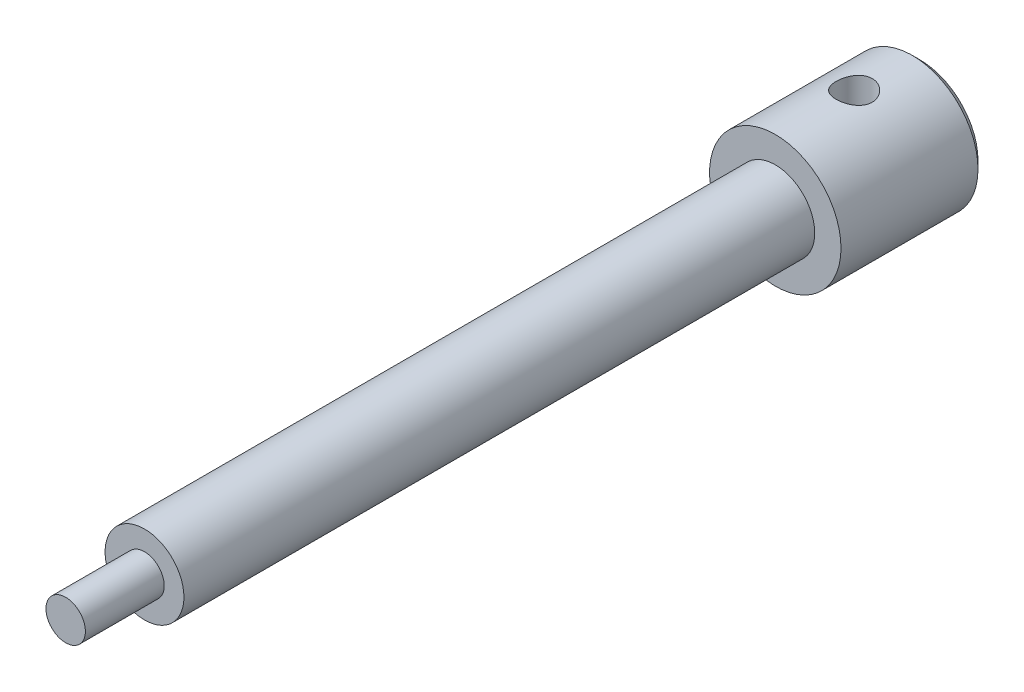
ISO-10303-21;
HEADER;
FILE_DESCRIPTION(('STEP AP214'),'2;1');
FILE_NAME('part.step','',(''),(''),'','','');
FILE_SCHEMA(('AUTOMOTIVE_DESIGN { 1 0 10303 214 1 1 1 1 }'));
ENDSEC;
DATA;
#1=APPLICATION_CONTEXT('core data for automotive mechanical design processes');
#2=APPLICATION_PROTOCOL_DEFINITION('international standard','automotive_design',2000,#1);
#3=PRODUCT_CONTEXT('',#1,'mechanical');
#4=PRODUCT('Part','Part','',(#3));
#5=PRODUCT_RELATED_PRODUCT_CATEGORY('part','',(#4));
#6=PRODUCT_DEFINITION_FORMATION('','',#4);
#7=PRODUCT_DEFINITION_CONTEXT('part definition',#1,'design');
#8=PRODUCT_DEFINITION('design','',#6,#7);
#9=PRODUCT_DEFINITION_SHAPE('','',#8);
#10=(LENGTH_UNIT() NAMED_UNIT(*) SI_UNIT(.MILLI.,.METRE.));
#11=(NAMED_UNIT(*) PLANE_ANGLE_UNIT() SI_UNIT($,.RADIAN.));
#12=(NAMED_UNIT(*) SI_UNIT($,.STERADIAN.) SOLID_ANGLE_UNIT());
#13=UNCERTAINTY_MEASURE_WITH_UNIT(LENGTH_MEASURE(1.E-05),#10,'distance_accuracy_value','');
#14=(GEOMETRIC_REPRESENTATION_CONTEXT(3) GLOBAL_UNCERTAINTY_ASSIGNED_CONTEXT((#13)) GLOBAL_UNIT_ASSIGNED_CONTEXT((#10,
#11,#12)) REPRESENTATION_CONTEXT('',''));
#15=CARTESIAN_POINT('',(0.,0.,0.));
#16=DIRECTION('',(0.,0.,1.));
#17=DIRECTION('',(1.,0.,0.));
#18=AXIS2_PLACEMENT_3D('',#15,#16,#17);
#19=CARTESIAN_POINT('',(0.,0.,-22.));
#20=DIRECTION('',(0.,0.,1.));
#21=DIRECTION('',(1.,0.,0.));
#22=AXIS2_PLACEMENT_3D('',#19,#20,#21);
#23=CYLINDRICAL_SURFACE('',#22,10.);
#24=CARTESIAN_POINT('',(0.,0.,-20.85));
#25=DIRECTION('',(0.,0.,1.));
#26=DIRECTION('',(1.,0.,0.));
#27=AXIS2_PLACEMENT_3D('',#24,#25,#26);
#28=CIRCLE('',#27,10.);
#29=CARTESIAN_POINT('',(10.,0.,-20.85));
#30=VERTEX_POINT('',#29);
#31=EDGE_CURVE('E57',#30,#30,#28,.T.);
#32=ORIENTED_EDGE('',*,*,#31,.T.);
#33=EDGE_LOOP('',(#32));
#34=FACE_BOUND('',#33,.T.);
#35=CARTESIAN_POINT('',(0.,-10.,-9.25));
#36=CARTESIAN_POINT('',(-0.15142288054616,-9.99999790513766,-9.25000321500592));
#37=CARTESIAN_POINT('',(-0.30287955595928,-9.99652704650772,-9.26254850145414));
#38=CARTESIAN_POINT('',(-0.601418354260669,-9.9830186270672,-9.31230216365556));
#39=CARTESIAN_POINT('',(-0.748498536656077,-9.97297819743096,-9.34952131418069));
#40=CARTESIAN_POINT('',(-1.03393279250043,-9.94743692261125,-9.44731247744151));
#41=CARTESIAN_POINT('',(-1.17229822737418,-9.93194336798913,-9.50785332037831));
#42=CARTESIAN_POINT('',(-1.43691255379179,-9.89712668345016,-9.65045078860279));
#43=CARTESIAN_POINT('',(-1.56316043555,-9.8778032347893,-9.73250920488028));
#44=CARTESIAN_POINT('',(-1.80305227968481,-9.83687707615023,-9.917936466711));
#45=CARTESIAN_POINT('',(-1.91635675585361,-9.81523348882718,-10.0217354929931));
#46=CARTESIAN_POINT('',(-2.12418937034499,-9.77236429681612,-10.2467786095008));
#47=CARTESIAN_POINT('',(-2.21871492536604,-9.75113874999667,-10.3680250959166));
#48=CARTESIAN_POINT('',(-2.3879928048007,-9.71108741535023,-10.6272699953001));
#49=CARTESIAN_POINT('',(-2.46234890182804,-9.69231302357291,-10.7655358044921));
#50=CARTESIAN_POINT('',(-2.58662289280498,-9.65989315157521,-11.0532068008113));
#51=CARTESIAN_POINT('',(-2.63654561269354,-9.64624665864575,-11.202609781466));
#52=CARTESIAN_POINT('',(-2.70934583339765,-9.62605068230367,-11.5045411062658));
#53=CARTESIAN_POINT('',(-2.73284141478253,-9.61933931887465,-11.6569093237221));
#54=CARTESIAN_POINT('',(-2.75404817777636,-9.61329031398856,-11.9635612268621));
#55=CARTESIAN_POINT('',(-2.75176451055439,-9.61395119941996,-12.1178445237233));
#56=CARTESIAN_POINT('',(-2.72196703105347,-9.62242747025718,-12.4190757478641));
#57=CARTESIAN_POINT('',(-2.69520726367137,-9.63002901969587,-12.5661052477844));
#58=CARTESIAN_POINT('',(-2.61842742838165,-9.65118687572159,-12.8535025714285));
#59=CARTESIAN_POINT('',(-2.56840539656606,-9.66474368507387,-12.9938698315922));
#60=CARTESIAN_POINT('',(-2.4459209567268,-9.6964683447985,-13.2658944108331));
#61=CARTESIAN_POINT('',(-2.37319900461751,-9.71468906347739,-13.3974284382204));
#62=CARTESIAN_POINT('',(-2.20755990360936,-9.75366083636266,-13.6466884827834));
#63=CARTESIAN_POINT('',(-2.11463855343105,-9.77441241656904,-13.7644116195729));
#64=CARTESIAN_POINT('',(-1.90740929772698,-9.81699239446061,-13.9870091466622));
#65=CARTESIAN_POINT('',(-1.79246989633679,-9.83883313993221,-14.0912941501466));
#66=CARTESIAN_POINT('',(-1.54646529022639,-9.88048509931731,-14.2792334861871));
#67=CARTESIAN_POINT('',(-1.41539936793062,-9.90029622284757,-14.3628869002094));
#68=CARTESIAN_POINT('',(-1.13991171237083,-9.93579173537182,-14.5074709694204));
#69=CARTESIAN_POINT('',(-0.99542816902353,-9.95145560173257,-14.5682892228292));
#70=CARTESIAN_POINT('',(-0.697756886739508,-9.97674362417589,-14.6645994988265));
#71=CARTESIAN_POINT('',(-0.544571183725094,-9.98636918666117,-14.7000974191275));
#72=CARTESIAN_POINT('',(-0.238869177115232,-9.9982810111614,-14.7438206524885));
#73=CARTESIAN_POINT('',(-0.0864756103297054,-10.000782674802,-14.7528466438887));
#74=CARTESIAN_POINT('',(0.217649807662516,-9.9987871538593,-14.7455888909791));
#75=CARTESIAN_POINT('',(0.369381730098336,-9.99429074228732,-14.7293079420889));
#76=CARTESIAN_POINT('',(0.664979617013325,-9.97894393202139,-14.6725532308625));
#77=CARTESIAN_POINT('',(0.808939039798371,-9.9682122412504,-14.6325311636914));
#78=CARTESIAN_POINT('',(1.0880827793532,-9.94161719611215,-14.5299593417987));
#79=CARTESIAN_POINT('',(1.22326611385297,-9.92575326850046,-14.4674070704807));
#80=CARTESIAN_POINT('',(1.48409215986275,-9.8901549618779,-14.3200996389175));
#81=CARTESIAN_POINT('',(1.60948250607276,-9.8703479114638,-14.2349156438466));
#82=CARTESIAN_POINT('',(1.84446827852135,-9.82915015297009,-14.0452974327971));
#83=CARTESIAN_POINT('',(1.95406037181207,-9.80775911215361,-13.9408591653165));
#84=CARTESIAN_POINT('',(2.15775026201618,-9.7650031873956,-13.7119525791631));
#85=CARTESIAN_POINT('',(2.251281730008,-9.74365851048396,-13.5869755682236));
#86=CARTESIAN_POINT('',(2.41606367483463,-9.70411480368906,-13.3226441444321));
#87=CARTESIAN_POINT('',(2.48731502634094,-9.68591565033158,-13.183290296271));
#88=CARTESIAN_POINT('',(2.60498194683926,-9.65493519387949,-12.8948127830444));
#89=CARTESIAN_POINT('',(2.65153712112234,-9.64212352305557,-12.7457495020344));
#90=CARTESIAN_POINT('',(2.71879365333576,-9.62337795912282,-12.4414941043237));
#91=CARTESIAN_POINT('',(2.73950213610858,-9.61744217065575,-12.2863036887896));
#92=CARTESIAN_POINT('',(2.75404886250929,-9.6132857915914,-11.9800168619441));
#93=CARTESIAN_POINT('',(2.7488002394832,-9.614803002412,-11.8289667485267));
#94=CARTESIAN_POINT('',(2.71371466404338,-9.62476380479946,-11.5299943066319));
#95=CARTESIAN_POINT('',(2.6838784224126,-9.63320719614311,-11.3820718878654));
#96=CARTESIAN_POINT('',(2.60100915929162,-9.65590796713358,-11.0947850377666));
#97=CARTESIAN_POINT('',(2.54818121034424,-9.67011387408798,-10.955357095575));
#98=CARTESIAN_POINT('',(2.4209868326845,-9.70273746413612,-10.6872356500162));
#99=CARTESIAN_POINT('',(2.34661683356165,-9.72115584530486,-10.5585439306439));
#100=CARTESIAN_POINT('',(2.17573113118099,-9.76084545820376,-10.31121804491));
#101=CARTESIAN_POINT('',(2.07859788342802,-9.78218767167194,-10.1930219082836));
#102=CARTESIAN_POINT('',(1.86610223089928,-9.82493707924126,-9.97431048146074));
#103=CARTESIAN_POINT('',(1.75073533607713,-9.84634428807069,-9.87379955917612));
#104=CARTESIAN_POINT('',(1.50182041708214,-9.88740569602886,-9.69101234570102));
#105=CARTESIAN_POINT('',(1.36791284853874,-9.907007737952,-9.60921290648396));
#106=CARTESIAN_POINT('',(1.08770978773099,-9.94166772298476,-9.46941355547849));
#107=CARTESIAN_POINT('',(0.941421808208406,-9.95672839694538,-9.41139933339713));
#108=CARTESIAN_POINT('',(0.663199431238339,-9.97880995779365,-9.3278272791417));
#109=CARTESIAN_POINT('',(0.532391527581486,-9.9866965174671,-9.29871242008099));
#110=CARTESIAN_POINT('',(0.267730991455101,-9.9972921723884,-9.25979844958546));
#111=CARTESIAN_POINT('',(0.13387870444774,-10.0000018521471,-9.24999715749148));
#112=CARTESIAN_POINT('',(0.,-10.,-9.25));
#113=B_SPLINE_CURVE_WITH_KNOTS('',3,(#35,#36,#37,#38,#39,#40,#41,#42,#43,#44,#45,#46,#47,#48,
#49,#50,#51,#52,#53,#54,#55,#56,#57,#58,#59,#60,#61,#62,#63,#64,#65,#66,#67,#68,#69,#70,#71,#72,
#73,#74,#75,#76,#77,#78,#79,#80,#81,#82,#83,#84,#85,#86,#87,#88,#89,#90,#91,#92,#93,#94,#95,#96,
#97,#98,#99,#100,#101,#102,#103,#104,#105,#106,#107,#108,#109,#110,#111,#112),.UNSPECIFIED.,.T.,
.F.,(4,2,2,2,2,2,2,2,2,2,2,2,2,2,2,2,2,2,2,2,2,2,2,2,2,2,2,2,2,2,2,2,2,2,2,2,2,2,4),(0.,
0.45377748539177,0.907753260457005,1.36112438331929,1.81453325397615,2.27794447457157,
2.74141939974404,3.21343018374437,3.68534770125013,4.14598225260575,4.60652476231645,
5.0533402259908,5.50019341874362,5.9523554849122,6.40461168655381,6.87259959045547,
7.34060832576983,7.81089145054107,8.28106499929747,8.73686293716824,9.19261053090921,
9.63995333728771,10.0873461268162,10.5439096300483,11.0005693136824,11.4709880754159,
11.9413883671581,12.4091004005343,12.8766834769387,13.3279371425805,13.7791777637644,
14.2264735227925,14.6738434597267,15.1351456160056,15.5965615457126,16.0686764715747,
16.5405069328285,16.9417541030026,17.3429559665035),.UNSPECIFIED.);
#114=CARTESIAN_POINT('',(0.,-10.,-9.25));
#115=VERTEX_POINT('',#114);
#116=EDGE_CURVE('E61',#115,#115,#113,.T.);
#117=ORIENTED_EDGE('',*,*,#116,.F.);
#118=EDGE_LOOP('',(#117));
#119=FACE_BOUND('',#118,.T.);
#120=CARTESIAN_POINT('',(0.,10.,-9.25));
#121=CARTESIAN_POINT('',(0.15142288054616,9.99999790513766,-9.25000321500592));
#122=CARTESIAN_POINT('',(0.30287955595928,9.99652704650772,-9.26254850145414));
#123=CARTESIAN_POINT('',(0.601418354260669,9.9830186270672,-9.31230216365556));
#124=CARTESIAN_POINT('',(0.748498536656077,9.97297819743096,-9.34952131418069));
#125=CARTESIAN_POINT('',(1.03393279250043,9.94743692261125,-9.44731247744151));
#126=CARTESIAN_POINT('',(1.17229822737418,9.93194336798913,-9.50785332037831));
#127=CARTESIAN_POINT('',(1.43691255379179,9.89712668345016,-9.65045078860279));
#128=CARTESIAN_POINT('',(1.56316043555,9.8778032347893,-9.73250920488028));
#129=CARTESIAN_POINT('',(1.80305227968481,9.83687707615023,-9.917936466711));
#130=CARTESIAN_POINT('',(1.91635675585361,9.81523348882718,-10.0217354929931));
#131=CARTESIAN_POINT('',(2.12418937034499,9.77236429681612,-10.2467786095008));
#132=CARTESIAN_POINT('',(2.21871492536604,9.75113874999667,-10.3680250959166));
#133=CARTESIAN_POINT('',(2.3879928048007,9.71108741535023,-10.6272699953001));
#134=CARTESIAN_POINT('',(2.46234890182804,9.69231302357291,-10.7655358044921));
#135=CARTESIAN_POINT('',(2.58662289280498,9.65989315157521,-11.0532068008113));
#136=CARTESIAN_POINT('',(2.63654561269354,9.64624665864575,-11.202609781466));
#137=CARTESIAN_POINT('',(2.70934583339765,9.62605068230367,-11.5045411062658));
#138=CARTESIAN_POINT('',(2.73284141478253,9.61933931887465,-11.6569093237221));
#139=CARTESIAN_POINT('',(2.75404817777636,9.61329031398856,-11.9635612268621));
#140=CARTESIAN_POINT('',(2.75176451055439,9.61395119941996,-12.1178445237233));
#141=CARTESIAN_POINT('',(2.72196703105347,9.62242747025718,-12.4190757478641));
#142=CARTESIAN_POINT('',(2.69520726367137,9.63002901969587,-12.5661052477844));
#143=CARTESIAN_POINT('',(2.61842742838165,9.65118687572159,-12.8535025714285));
#144=CARTESIAN_POINT('',(2.56840539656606,9.66474368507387,-12.9938698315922));
#145=CARTESIAN_POINT('',(2.4459209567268,9.6964683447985,-13.2658944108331));
#146=CARTESIAN_POINT('',(2.37319900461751,9.71468906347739,-13.3974284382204));
#147=CARTESIAN_POINT('',(2.20755990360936,9.75366083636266,-13.6466884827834));
#148=CARTESIAN_POINT('',(2.11463855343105,9.77441241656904,-13.7644116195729));
#149=CARTESIAN_POINT('',(1.90740929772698,9.81699239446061,-13.9870091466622));
#150=CARTESIAN_POINT('',(1.79246989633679,9.83883313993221,-14.0912941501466));
#151=CARTESIAN_POINT('',(1.54646529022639,9.88048509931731,-14.2792334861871));
#152=CARTESIAN_POINT('',(1.41539936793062,9.90029622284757,-14.3628869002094));
#153=CARTESIAN_POINT('',(1.13991171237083,9.93579173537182,-14.5074709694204));
#154=CARTESIAN_POINT('',(0.99542816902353,9.95145560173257,-14.5682892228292));
#155=CARTESIAN_POINT('',(0.697756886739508,9.97674362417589,-14.6645994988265));
#156=CARTESIAN_POINT('',(0.544571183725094,9.98636918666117,-14.7000974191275));
#157=CARTESIAN_POINT('',(0.238869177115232,9.9982810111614,-14.7438206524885));
#158=CARTESIAN_POINT('',(0.0864756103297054,10.000782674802,-14.7528466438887));
#159=CARTESIAN_POINT('',(-0.217649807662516,9.9987871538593,-14.7455888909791));
#160=CARTESIAN_POINT('',(-0.369381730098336,9.99429074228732,-14.7293079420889));
#161=CARTESIAN_POINT('',(-0.664979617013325,9.97894393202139,-14.6725532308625));
#162=CARTESIAN_POINT('',(-0.808939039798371,9.9682122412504,-14.6325311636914));
#163=CARTESIAN_POINT('',(-1.0880827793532,9.94161719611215,-14.5299593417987));
#164=CARTESIAN_POINT('',(-1.22326611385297,9.92575326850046,-14.4674070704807));
#165=CARTESIAN_POINT('',(-1.48409215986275,9.8901549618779,-14.3200996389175));
#166=CARTESIAN_POINT('',(-1.60948250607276,9.8703479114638,-14.2349156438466));
#167=CARTESIAN_POINT('',(-1.84446827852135,9.82915015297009,-14.0452974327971));
#168=CARTESIAN_POINT('',(-1.95406037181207,9.80775911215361,-13.9408591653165));
#169=CARTESIAN_POINT('',(-2.15775026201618,9.7650031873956,-13.7119525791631));
#170=CARTESIAN_POINT('',(-2.251281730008,9.74365851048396,-13.5869755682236));
#171=CARTESIAN_POINT('',(-2.41606367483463,9.70411480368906,-13.3226441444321));
#172=CARTESIAN_POINT('',(-2.48731502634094,9.68591565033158,-13.183290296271));
#173=CARTESIAN_POINT('',(-2.60498194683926,9.65493519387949,-12.8948127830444));
#174=CARTESIAN_POINT('',(-2.65153712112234,9.64212352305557,-12.7457495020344));
#175=CARTESIAN_POINT('',(-2.71879365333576,9.62337795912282,-12.4414941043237));
#176=CARTESIAN_POINT('',(-2.73950213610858,9.61744217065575,-12.2863036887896));
#177=CARTESIAN_POINT('',(-2.75404886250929,9.6132857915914,-11.9800168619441));
#178=CARTESIAN_POINT('',(-2.7488002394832,9.614803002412,-11.8289667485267));
#179=CARTESIAN_POINT('',(-2.71371466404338,9.62476380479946,-11.5299943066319));
#180=CARTESIAN_POINT('',(-2.6838784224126,9.63320719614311,-11.3820718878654));
#181=CARTESIAN_POINT('',(-2.60100915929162,9.65590796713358,-11.0947850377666));
#182=CARTESIAN_POINT('',(-2.54818121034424,9.67011387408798,-10.955357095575));
#183=CARTESIAN_POINT('',(-2.4209868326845,9.70273746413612,-10.6872356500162));
#184=CARTESIAN_POINT('',(-2.34661683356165,9.72115584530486,-10.5585439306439));
#185=CARTESIAN_POINT('',(-2.17573113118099,9.76084545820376,-10.31121804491));
#186=CARTESIAN_POINT('',(-2.07859788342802,9.78218767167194,-10.1930219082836));
#187=CARTESIAN_POINT('',(-1.86610223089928,9.82493707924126,-9.97431048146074));
#188=CARTESIAN_POINT('',(-1.75073533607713,9.84634428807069,-9.87379955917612));
#189=CARTESIAN_POINT('',(-1.50182041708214,9.88740569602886,-9.69101234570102));
#190=CARTESIAN_POINT('',(-1.36791284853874,9.907007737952,-9.60921290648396));
#191=CARTESIAN_POINT('',(-1.08770978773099,9.94166772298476,-9.46941355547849));
#192=CARTESIAN_POINT('',(-0.941421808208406,9.95672839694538,-9.41139933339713));
#193=CARTESIAN_POINT('',(-0.663199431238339,9.97880995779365,-9.3278272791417));
#194=CARTESIAN_POINT('',(-0.532391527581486,9.9866965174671,-9.29871242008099));
#195=CARTESIAN_POINT('',(-0.267730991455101,9.9972921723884,-9.25979844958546));
#196=CARTESIAN_POINT('',(-0.13387870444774,10.0000018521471,-9.24999715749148));
#197=CARTESIAN_POINT('',(0.,10.,-9.25));
#198=B_SPLINE_CURVE_WITH_KNOTS('',3,(#120,#121,#122,#123,#124,#125,#126,#127,#128,#129,#130,
#131,#132,#133,#134,#135,#136,#137,#138,#139,#140,#141,#142,#143,#144,#145,#146,#147,#148,#149,
#150,#151,#152,#153,#154,#155,#156,#157,#158,#159,#160,#161,#162,#163,#164,#165,#166,#167,#168,
#169,#170,#171,#172,#173,#174,#175,#176,#177,#178,#179,#180,#181,#182,#183,#184,#185,#186,#187,
#188,#189,#190,#191,#192,#193,#194,#195,#196,#197),.UNSPECIFIED.,.T.,.F.,(4,2,2,2,2,2,2,2,2,2,2,
2,2,2,2,2,2,2,2,2,2,2,2,2,2,2,2,2,2,2,2,2,2,2,2,2,2,2,4),(0.,0.45377748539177,0.907753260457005,
1.36112438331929,1.81453325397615,2.27794447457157,2.74141939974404,3.21343018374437,
3.68534770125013,4.14598225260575,4.60652476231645,5.0533402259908,5.50019341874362,
5.9523554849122,6.40461168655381,6.87259959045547,7.34060832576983,7.81089145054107,
8.28106499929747,8.73686293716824,9.19261053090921,9.63995333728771,10.0873461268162,
10.5439096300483,11.0005693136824,11.4709880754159,11.9413883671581,12.4091004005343,
12.8766834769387,13.3279371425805,13.7791777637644,14.2264735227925,14.6738434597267,
15.1351456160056,15.5965615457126,16.0686764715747,16.5405069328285,16.9417541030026,
17.3429559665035),.UNSPECIFIED.);
#199=CARTESIAN_POINT('',(0.,10.,-9.25));
#200=VERTEX_POINT('',#199);
#201=EDGE_CURVE('E65',#200,#200,#198,.T.);
#202=ORIENTED_EDGE('',*,*,#201,.F.);
#203=EDGE_LOOP('',(#202));
#204=FACE_BOUND('',#203,.T.);
#205=CARTESIAN_POINT('',(0.,0.,0.));
#206=DIRECTION('',(0.,0.,1.));
#207=DIRECTION('',(1.,0.,0.));
#208=AXIS2_PLACEMENT_3D('',#205,#206,#207);
#209=CIRCLE('',#208,10.);
#210=CARTESIAN_POINT('',(10.,0.,0.));
#211=VERTEX_POINT('',#210);
#212=EDGE_CURVE('E121',#211,#211,#209,.T.);
#213=ORIENTED_EDGE('',*,*,#212,.F.);
#214=EDGE_LOOP('',(#213));
#215=FACE_BOUND('',#214,.T.);
#216=ADVANCED_FACE('F49',(#34,#119,#204,#215),#23,.T.);
#217=CARTESIAN_POINT('',(0.,0.,-22.));
#218=DIRECTION('',(0.,0.,1.));
#219=DIRECTION('',(1.,0.,0.));
#220=AXIS2_PLACEMENT_3D('',#217,#218,#219);
#221=PLANE('',#220);
#222=CARTESIAN_POINT('',(0.,0.,-22.));
#223=DIRECTION('',(0.,0.,1.));
#224=DIRECTION('',(1.,0.,0.));
#225=AXIS2_PLACEMENT_3D('',#222,#223,#224);
#226=CIRCLE('',#225,8.85000000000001);
#227=CARTESIAN_POINT('',(8.85000000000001,0.,-22.));
#228=VERTEX_POINT('',#227);
#229=EDGE_CURVE('E10',#228,#228,#226,.F.);
#230=ORIENTED_EDGE('',*,*,#229,.T.);
#231=EDGE_LOOP('',(#230));
#232=FACE_BOUND('',#231,.T.);
#233=ADVANCED_FACE('F101',(#232),#221,.F.);
#234=CARTESIAN_POINT('',(0.,0.,0.));
#235=DIRECTION('',(0.,0.,1.));
#236=DIRECTION('',(1.,0.,0.));
#237=AXIS2_PLACEMENT_3D('',#234,#235,#236);
#238=PLANE('',#237);
#239=CARTESIAN_POINT('',(0.,0.,0.));
#240=DIRECTION('',(0.,0.,1.));
#241=DIRECTION('',(1.,0.,0.));
#242=AXIS2_PLACEMENT_3D('',#239,#240,#241);
#243=CIRCLE('',#242,6.);
#244=CARTESIAN_POINT('',(6.,0.,0.));
#245=VERTEX_POINT('',#244);
#246=EDGE_CURVE('E122',#245,#245,#243,.T.);
#247=ORIENTED_EDGE('',*,*,#246,.F.);
#248=EDGE_LOOP('',(#247));
#249=FACE_BOUND('',#248,.T.);
#250=ORIENTED_EDGE('',*,*,#212,.T.);
#251=EDGE_LOOP('',(#250));
#252=FACE_BOUND('',#251,.T.);
#253=ADVANCED_FACE('F99',(#249,#252),#238,.T.);
#254=CARTESIAN_POINT('',(0.,0.,96.));
#255=DIRECTION('',(0.,0.,-1.));
#256=DIRECTION('',(-1.,0.,0.));
#257=AXIS2_PLACEMENT_3D('',#254,#255,#256);
#258=CYLINDRICAL_SURFACE('',#257,6.);
#259=CARTESIAN_POINT('',(0.,0.,96.));
#260=DIRECTION('',(0.,0.,1.));
#261=DIRECTION('',(1.,0.,0.));
#262=AXIS2_PLACEMENT_3D('',#259,#260,#261);
#263=CIRCLE('',#262,6.);
#264=CARTESIAN_POINT('',(6.,0.,96.));
#265=VERTEX_POINT('',#264);
#266=EDGE_CURVE('E123',#265,#265,#263,.T.);
#267=ORIENTED_EDGE('',*,*,#266,.F.);
#268=EDGE_LOOP('',(#267));
#269=FACE_BOUND('',#268,.T.);
#270=ORIENTED_EDGE('',*,*,#246,.T.);
#271=EDGE_LOOP('',(#270));
#272=FACE_BOUND('',#271,.T.);
#273=ADVANCED_FACE('F95',(#269,#272),#258,.T.);
#274=CARTESIAN_POINT('',(0.,0.,96.));
#275=DIRECTION('',(0.,0.,1.));
#276=DIRECTION('',(1.,0.,0.));
#277=AXIS2_PLACEMENT_3D('',#274,#275,#276);
#278=PLANE('',#277);
#279=CARTESIAN_POINT('',(0.,0.,96.));
#280=DIRECTION('',(0.,0.,1.));
#281=DIRECTION('',(1.,0.,0.));
#282=AXIS2_PLACEMENT_3D('',#279,#280,#281);
#283=CIRCLE('',#282,3.);
#284=CARTESIAN_POINT('',(3.,0.,96.));
#285=VERTEX_POINT('',#284);
#286=EDGE_CURVE('E125',#285,#285,#283,.T.);
#287=ORIENTED_EDGE('',*,*,#286,.F.);
#288=EDGE_LOOP('',(#287));
#289=FACE_BOUND('',#288,.T.);
#290=ORIENTED_EDGE('',*,*,#266,.T.);
#291=EDGE_LOOP('',(#290));
#292=FACE_BOUND('',#291,.T.);
#293=ADVANCED_FACE('F91',(#289,#292),#278,.T.);
#294=CARTESIAN_POINT('',(0.,0.,108.));
#295=DIRECTION('',(0.,0.,-1.));
#296=DIRECTION('',(-1.,0.,0.));
#297=AXIS2_PLACEMENT_3D('',#294,#295,#296);
#298=CYLINDRICAL_SURFACE('',#297,3.);
#299=CARTESIAN_POINT('',(0.,0.,108.));
#300=DIRECTION('',(0.,0.,1.));
#301=DIRECTION('',(1.,0.,0.));
#302=AXIS2_PLACEMENT_3D('',#299,#300,#301);
#303=CIRCLE('',#302,3.);
#304=CARTESIAN_POINT('',(3.,0.,108.));
#305=VERTEX_POINT('',#304);
#306=EDGE_CURVE('E128',#305,#305,#303,.T.);
#307=ORIENTED_EDGE('',*,*,#306,.F.);
#308=EDGE_LOOP('',(#307));
#309=FACE_BOUND('',#308,.T.);
#310=ORIENTED_EDGE('',*,*,#286,.T.);
#311=EDGE_LOOP('',(#310));
#312=FACE_BOUND('',#311,.T.);
#313=ADVANCED_FACE('F87',(#309,#312),#298,.T.);
#314=CARTESIAN_POINT('',(0.,0.,108.));
#315=DIRECTION('',(0.,0.,1.));
#316=DIRECTION('',(1.,0.,0.));
#317=AXIS2_PLACEMENT_3D('',#314,#315,#316);
#318=PLANE('',#317);
#319=ORIENTED_EDGE('',*,*,#306,.T.);
#320=EDGE_LOOP('',(#319));
#321=FACE_BOUND('',#320,.T.);
#322=ADVANCED_FACE('F82',(#321),#318,.T.);
#323=CARTESIAN_POINT('',(0.,-10.,-12.));
#324=DIRECTION('',(0.,1.,0.));
#325=DIRECTION('',(0.,0.,1.));
#326=AXIS2_PLACEMENT_3D('',#323,#324,#325);
#327=CYLINDRICAL_SURFACE('',#326,2.75);
#328=ORIENTED_EDGE('',*,*,#116,.T.);
#329=EDGE_LOOP('',(#328));
#330=FACE_BOUND('',#329,.T.);
#331=ORIENTED_EDGE('',*,*,#201,.T.);
#332=EDGE_LOOP('',(#331));
#333=FACE_BOUND('',#332,.T.);
#334=ADVANCED_FACE('F78',(#330,#333),#327,.F.);
#335=CARTESIAN_POINT('',(0.,0.,-20.85));
#336=DIRECTION('',(0.,0.,1.));
#337=DIRECTION('',(1.,0.,0.));
#338=AXIS2_PLACEMENT_3D('',#335,#336,#337);
#339=CONICAL_SURFACE('',#338,10.,0.785398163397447);
#340=ORIENTED_EDGE('',*,*,#229,.F.);
#341=EDGE_LOOP('',(#340));
#342=FACE_BOUND('',#341,.T.);
#343=ORIENTED_EDGE('',*,*,#31,.F.);
#344=EDGE_LOOP('',(#343));
#345=FACE_BOUND('',#344,.T.);
#346=ADVANCED_FACE('F52',(#342,#345),#339,.T.);
#347=CLOSED_SHELL('',(#216,#233,#253,#273,#293,#313,#322,#334,#346));
#348=MANIFOLD_SOLID_BREP('B2',#347);
#349=ADVANCED_BREP_SHAPE_REPRESENTATION('',(#18,#348),#14);
#350=SHAPE_DEFINITION_REPRESENTATION(#9,#349);
ENDSEC;
END-ISO-10303-21;
